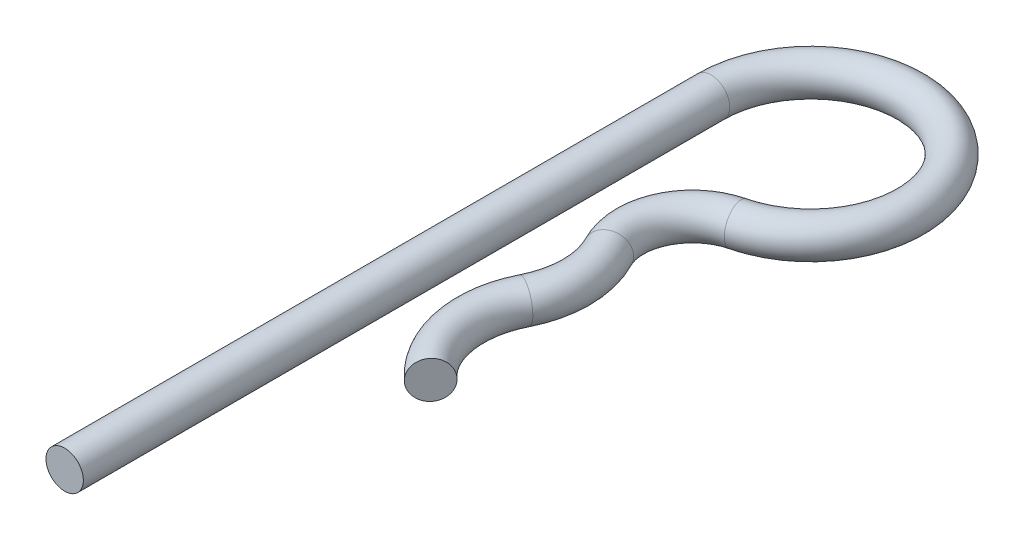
from build123d import *

# Parameters (mm, degrees)
ESQUISSE3_R = 1.5


with BuildPart() as part:
    # Balayage1: sweep along a path in Esquisse2
    with BuildLine(Plane(origin=(0, 0, 0), x_dir=(1, 0, 0), z_dir=(0, 1, 0))) as balayage1_path:
        Line((0, 0), (0, 51.863084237))
        ThreePointArc((0, 51.863084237), (12.930477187, 58.163115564), (9.922598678, 44.097544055))
        ThreePointArc((9.922598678, 44.097544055), (6.573687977, 41.315948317), (6.674533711, 36.963672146))
        ThreePointArc((6.674533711, 36.963672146), (7.499917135, 33.578313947), (6.706397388, 30.185345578))
        ThreePointArc((6.706397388, 30.185345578), (6.016090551, 25.259619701), (8.447093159, 20.920319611))
    # Esquisse3 → Balayage1 (sweep)
    with BuildSketch(Plane.XY):
        Circle(ESQUISSE3_R)
    sweep(path=balayage1_path.line)


solid = part.part
